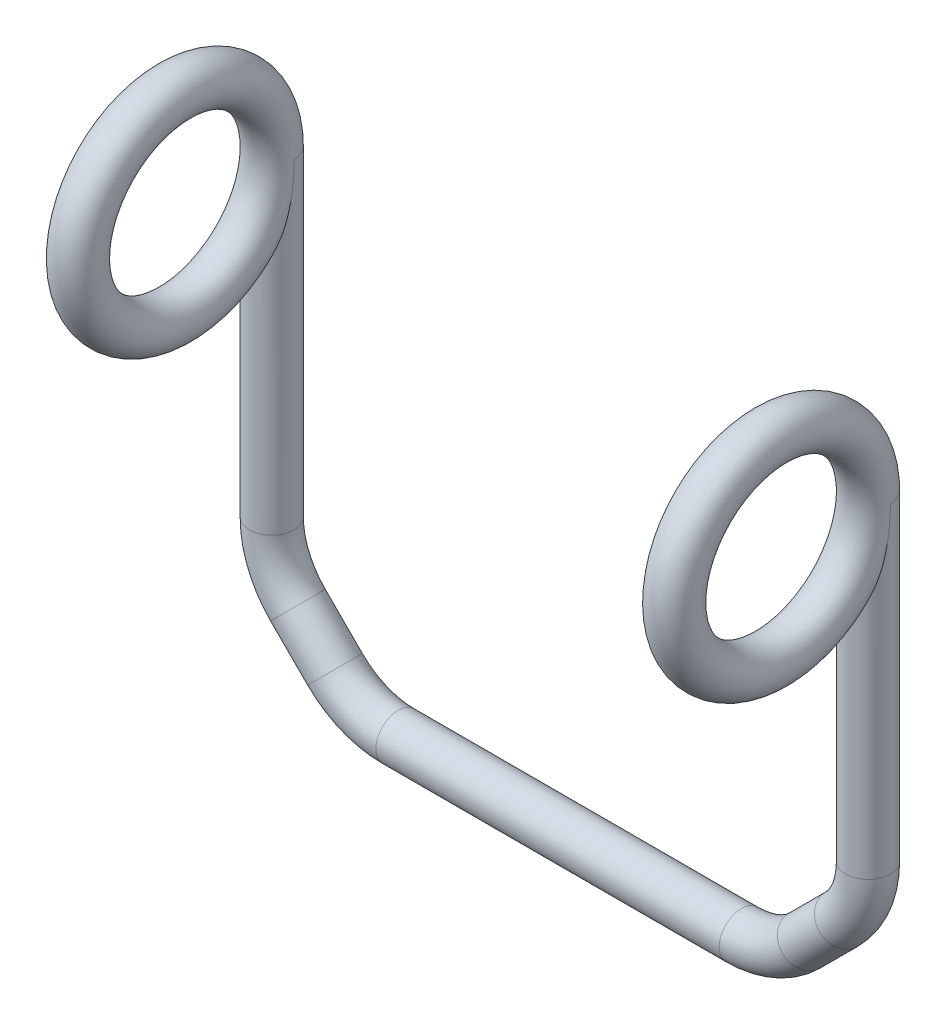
ISO-10303-21;
HEADER;
FILE_DESCRIPTION(('STEP AP214'),'2;1');
FILE_NAME('part.step','',(''),(''),'','','');
FILE_SCHEMA(('AUTOMOTIVE_DESIGN { 1 0 10303 214 1 1 1 1 }'));
ENDSEC;
DATA;
#1=APPLICATION_CONTEXT('core data for automotive mechanical design processes');
#2=APPLICATION_PROTOCOL_DEFINITION('international standard','automotive_design',2000,#1);
#3=PRODUCT_CONTEXT('',#1,'mechanical');
#4=PRODUCT('Part','Part','',(#3));
#5=PRODUCT_RELATED_PRODUCT_CATEGORY('part','',(#4));
#6=PRODUCT_DEFINITION_FORMATION('','',#4);
#7=PRODUCT_DEFINITION_CONTEXT('part definition',#1,'design');
#8=PRODUCT_DEFINITION('design','',#6,#7);
#9=PRODUCT_DEFINITION_SHAPE('','',#8);
#10=(LENGTH_UNIT() NAMED_UNIT(*) SI_UNIT(.MILLI.,.METRE.));
#11=(NAMED_UNIT(*) PLANE_ANGLE_UNIT() SI_UNIT($,.RADIAN.));
#12=(NAMED_UNIT(*) SI_UNIT($,.STERADIAN.) SOLID_ANGLE_UNIT());
#13=UNCERTAINTY_MEASURE_WITH_UNIT(LENGTH_MEASURE(1.E-05),#10,'distance_accuracy_value','');
#14=(GEOMETRIC_REPRESENTATION_CONTEXT(3) GLOBAL_UNCERTAINTY_ASSIGNED_CONTEXT((#13)) GLOBAL_UNIT_ASSIGNED_CONTEXT((#10,
#11,#12)) REPRESENTATION_CONTEXT('',''));
#15=CARTESIAN_POINT('',(0.,0.,0.));
#16=DIRECTION('',(0.,0.,1.));
#17=DIRECTION('',(1.,0.,0.));
#18=AXIS2_PLACEMENT_3D('',#15,#16,#17);
#19=CARTESIAN_POINT('',(10.,4.24264068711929,0.));
#20=DIRECTION('',(0.,1.,0.));
#21=DIRECTION('',(-1.,0.,0.));
#22=AXIS2_PLACEMENT_3D('',#19,#20,#21);
#23=CYLINDRICAL_SURFACE('',#22,0.75);
#24=CARTESIAN_POINT('',(10.,4.24264068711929,0.));
#25=DIRECTION('',(0.,1.,0.));
#26=DIRECTION('',(0.,0.,-1.));
#27=AXIS2_PLACEMENT_3D('',#24,#25,#26);
#28=CIRCLE('',#27,0.75);
#29=CARTESIAN_POINT('',(10.75,4.24264068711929,0.));
#30=VERTEX_POINT('',#29);
#31=EDGE_CURVE('E45',#30,#30,#28,.T.);
#32=ORIENTED_EDGE('',*,*,#31,.T.);
#33=EDGE_LOOP('',(#32));
#34=FACE_BOUND('',#33,.T.);
#35=CARTESIAN_POINT('',(10.,15.,0.));
#36=DIRECTION('',(0.,1.,0.));
#37=DIRECTION('',(0.,0.,-1.));
#38=AXIS2_PLACEMENT_3D('',#35,#36,#37);
#39=CIRCLE('',#38,0.75);
#40=CARTESIAN_POINT('',(10.75,15.,0.));
#41=VERTEX_POINT('',#40);
#42=CARTESIAN_POINT('',(9.24999999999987,15.0000000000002,0.));
#43=VERTEX_POINT('',#42);
#44=EDGE_CURVE('E11',#41,#43,#39,.T.);
#45=ORIENTED_EDGE('',*,*,#44,.F.);
#46=CARTESIAN_POINT('',(9.25,15.0000000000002,0.));
#47=CARTESIAN_POINT('',(9.25000006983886,14.9731247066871,-7.10896213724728E-09));
#48=CARTESIAN_POINT('',(9.24999994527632,14.9462500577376,0.000166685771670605));
#49=CARTESIAN_POINT('',(9.25000019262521,14.9162265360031,0.000539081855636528));
#50=CARTESIAN_POINT('',(9.25000022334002,14.913075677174,0.000580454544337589));
#51=CARTESIAN_POINT('',(9.25000040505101,14.8973214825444,0.000798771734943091));
#52=CARTESIAN_POINT('',(9.25000064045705,14.8847185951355,0.00101007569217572));
#53=CARTESIAN_POINT('',(9.25000118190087,14.8682614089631,0.00133386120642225));
#54=CARTESIAN_POINT('',(9.25000132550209,14.8644064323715,0.00141313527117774));
#55=CARTESIAN_POINT('',(9.2500021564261,14.8451318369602,0.00182664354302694));
#56=CARTESIAN_POINT('',(9.25000318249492,14.8297133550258,0.0022122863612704));
#57=CARTESIAN_POINT('',(9.25001072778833,14.752621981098,0.00441482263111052));
#58=CARTESIAN_POINT('',(9.25002449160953,14.6909697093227,0.00705434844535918));
#59=CARTESIAN_POINT('',(9.25012285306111,14.5696635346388,0.0139710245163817));
#60=CARTESIAN_POINT('',(9.25020525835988,14.5100065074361,0.0181952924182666));
#61=CARTESIAN_POINT('',(9.25066933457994,14.3312540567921,0.033309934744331));
#62=CARTESIAN_POINT('',(9.25126781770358,14.2123558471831,0.0466427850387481));
#63=CARTESIAN_POINT('',(9.25406503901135,13.9749948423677,0.0797301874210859));
#64=CARTESIAN_POINT('',(9.25627014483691,13.8565356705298,0.0995101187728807));
#65=CARTESIAN_POINT('',(9.2638999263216,13.6187518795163,0.145650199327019));
#66=CARTESIAN_POINT('',(9.2693827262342,13.4994510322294,0.172124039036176));
#67=CARTESIAN_POINT('',(9.28584512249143,13.2624571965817,0.231154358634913));
#68=CARTESIAN_POINT('',(9.29683458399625,13.1447674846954,0.263721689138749));
#69=CARTESIAN_POINT('',(9.31977026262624,12.970897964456,0.316456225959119));
#70=CARTESIAN_POINT('',(9.3284324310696,12.913661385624,0.33458290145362));
#71=CARTESIAN_POINT('',(9.34843273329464,12.8000623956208,0.372038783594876));
#72=CARTESIAN_POINT('',(9.35977004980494,12.7436997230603,0.391367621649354));
#73=CARTESIAN_POINT('',(9.38575021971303,12.632294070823,0.430995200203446));
#74=CARTESIAN_POINT('',(9.40038222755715,12.5772474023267,0.451290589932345));
#75=CARTESIAN_POINT('',(9.43385390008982,12.4687590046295,0.492634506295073));
#76=CARTESIAN_POINT('',(9.45268908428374,12.4153156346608,0.513682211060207));
#77=CARTESIAN_POINT('',(9.4823282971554,12.3435151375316,0.542809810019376));
#78=CARTESIAN_POINT('',(9.49078208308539,12.3241304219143,0.550762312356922));
#79=CARTESIAN_POINT('',(9.50854816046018,12.2857583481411,0.566672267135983));
#80=CARTESIAN_POINT('',(9.51786056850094,12.2667710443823,0.574629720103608));
#81=CARTESIAN_POINT('',(9.5472953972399,12.2103958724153,0.598498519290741));
#82=CARTESIAN_POINT('',(9.56886789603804,12.1737136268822,0.614357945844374));
#83=CARTESIAN_POINT('',(9.6171739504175,12.1027661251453,0.64559143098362));
#84=CARTESIAN_POINT('',(9.64397642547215,12.0685425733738,0.660955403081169));
#85=CARTESIAN_POINT('',(9.70384285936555,12.0051771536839,0.689844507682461));
#86=CARTESIAN_POINT('',(9.73686655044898,11.9760048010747,0.703380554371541));
#87=CARTESIAN_POINT('',(9.79059043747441,11.939731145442,0.720392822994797));
#88=CARTESIAN_POINT('',(9.80845628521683,11.9291618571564,0.725381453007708));
#89=CARTESIAN_POINT('',(9.84573166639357,11.9105265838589,0.734212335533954));
#90=CARTESIAN_POINT('',(9.86514027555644,11.9024591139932,0.738055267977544));
#91=CARTESIAN_POINT('',(9.90544323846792,11.8893883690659,0.744296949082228));
#92=CARTESIAN_POINT('',(9.92635104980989,11.8844181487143,0.746680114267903));
#93=CARTESIAN_POINT('',(9.96883760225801,11.8782205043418,0.749653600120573));
#94=CARTESIAN_POINT('',(9.99041560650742,11.8769891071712,0.750245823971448));
#95=CARTESIAN_POINT('',(10.0309279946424,11.878324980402,0.749604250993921));
#96=CARTESIAN_POINT('',(10.0498812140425,11.8804719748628,0.748572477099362));
#97=CARTESIAN_POINT('',(10.0871195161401,11.8875947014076,0.745158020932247));
#98=CARTESIAN_POINT('',(10.1054041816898,11.8925721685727,0.742774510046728));
#99=CARTESIAN_POINT('',(10.145937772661,11.9067153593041,0.736026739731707));
#100=CARTESIAN_POINT('',(10.1678483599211,11.9166668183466,0.73129323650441));
#101=CARTESIAN_POINT('',(10.2096133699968,11.9396369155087,0.720437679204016));
#102=CARTESIAN_POINT('',(10.2294635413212,11.9526617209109,0.714312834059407));
#103=CARTESIAN_POINT('',(10.2778961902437,11.9890695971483,0.69732400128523));
#104=CARTESIAN_POINT('',(10.3049691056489,12.0141129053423,0.685754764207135));
#105=CARTESIAN_POINT('',(10.354751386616,12.0676548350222,0.661378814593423));
#106=CARTESIAN_POINT('',(10.3774495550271,12.0961620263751,0.64856904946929));
#107=CARTESIAN_POINT('',(10.4185477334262,12.1544295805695,0.622803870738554));
#108=CARTESIAN_POINT('',(10.4370657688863,12.1841165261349,0.60986753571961));
#109=CARTESIAN_POINT('',(10.4713333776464,12.2449754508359,0.583786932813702));
#110=CARTESIAN_POINT('',(10.4870802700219,12.2761488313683,0.570642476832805));
#111=CARTESIAN_POINT('',(10.530922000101,12.3713693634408,0.531206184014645));
#112=CARTESIAN_POINT('',(10.5555549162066,12.437019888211,0.504954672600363));
#113=CARTESIAN_POINT('',(10.6023367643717,12.5836822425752,0.448631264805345));
#114=CARTESIAN_POINT('',(10.6230849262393,12.6652102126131,0.418801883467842));
#115=CARTESIAN_POINT('',(10.6579737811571,12.8305538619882,0.361511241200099));
#116=CARTESIAN_POINT('',(10.6721054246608,12.9143725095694,0.33405326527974));
#117=CARTESIAN_POINT('',(10.6955673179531,13.0835877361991,0.281959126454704));
#118=CARTESIAN_POINT('',(10.7048938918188,13.1689854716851,0.257325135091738));
#119=CARTESIAN_POINT('',(10.7200686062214,13.3409268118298,0.21116379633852));
#120=CARTESIAN_POINT('',(10.7259160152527,13.4274706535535,0.189637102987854));
#121=CARTESIAN_POINT('',(10.7356999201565,13.6116903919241,0.147534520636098));
#122=CARTESIAN_POINT('',(10.7393298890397,13.7094759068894,0.127369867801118));
#123=CARTESIAN_POINT('',(10.7446357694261,13.905746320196,0.091367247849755));
#124=CARTESIAN_POINT('',(10.7463144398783,14.0042300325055,0.0755231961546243));
#125=CARTESIAN_POINT('',(10.7481443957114,14.1645544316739,0.0533985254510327));
#126=CARTESIAN_POINT('',(10.7486329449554,14.2262081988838,0.0457646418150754));
#127=CARTESIAN_POINT('',(10.7493377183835,14.3497194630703,0.0322346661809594));
#128=CARTESIAN_POINT('',(10.7495538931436,14.41157699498,0.0263388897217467));
#129=CARTESIAN_POINT('',(10.749871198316,14.5490512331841,0.0152037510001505));
#130=CARTESIAN_POINT('',(10.7499365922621,14.6247033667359,0.0103935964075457));
#131=CARTESIAN_POINT('',(10.7499868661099,14.7450389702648,0.00484715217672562));
#132=CARTESIAN_POINT('',(10.7499937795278,14.7896845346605,0.00324909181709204));
#133=CARTESIAN_POINT('',(10.7499990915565,14.8626830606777,0.00138867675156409));
#134=CARTESIAN_POINT('',(10.7499996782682,14.8910290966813,0.000851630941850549));
#135=CARTESIAN_POINT('',(10.7499999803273,14.9462502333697,0.000166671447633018));
#136=CARTESIAN_POINT('',(10.7499997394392,14.9731251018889,-4.14173930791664E-08));
#137=CARTESIAN_POINT('',(10.75,15.0000000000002,0.));
#138=B_SPLINE_CURVE_WITH_KNOTS('',3,(#46,#47,#48,#49,#50,#51,#52,#53,#54,#55,#56,#57,#58,#59,
#60,#61,#62,#63,#64,#65,#66,#67,#68,#69,#70,#71,#72,#73,#74,#75,#76,#77,#78,#79,#80,#81,#82,#83,
#84,#85,#86,#87,#88,#89,#90,#91,#92,#93,#94,#95,#96,#97,#98,#99,#100,#101,#102,#103,#104,#105,
#106,#107,#108,#109,#110,#111,#112,#113,#114,#115,#116,#117,#118,#119,#120,#121,#122,#123,#124,
#125,#126,#127,#128,#129,#130,#131,#132,#133,#134,#135,#136,#137),.UNSPECIFIED.,.F.,.F.,(4,2,2,
2,2,2,2,2,2,2,2,2,2,2,2,2,2,2,2,2,2,2,2,2,2,2,2,2,2,2,2,2,2,2,2,2,2,2,2,2,2,2,2,2,2,4),(0.,
0.0806241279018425,0.0900775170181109,0.127891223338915,0.139458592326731,0.185728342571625,
0.370824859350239,0.55022661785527,0.908965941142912,1.2691348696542,1.63588853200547,
2.00330159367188,2.18522288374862,2.3670886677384,2.54836431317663,2.72944763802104,
2.79721136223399,2.86498430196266,3.00093940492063,3.13882454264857,3.27584609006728,
3.33970893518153,3.40353380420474,3.46802866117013,3.53245495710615,3.58947746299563,
3.64653496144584,3.71970233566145,3.79301780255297,3.90832098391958,4.02391547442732,
4.1356579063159,4.24750785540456,4.47157466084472,4.73895749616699,5.00670497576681,
5.27465698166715,5.54266530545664,5.84226765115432,6.14144587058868,6.32780250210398,
6.5141929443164,6.74155721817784,6.87557106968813,6.96062205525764,7.04124618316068),.UNSPECIFIED.);
#139=EDGE_CURVE('E52',#41,#43,#138,.F.);
#140=ORIENTED_EDGE('',*,*,#139,.T.);
#141=EDGE_LOOP('',(#45,#140));
#142=FACE_BOUND('',#141,.T.);
#143=ADVANCED_FACE('F37',(#34,#142),#23,.T.);
#144=CARTESIAN_POINT('',(7.,4.24264068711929,0.));
#145=DIRECTION('',(0.,0.,1.));
#146=DIRECTION('',(1.,0.,0.));
#147=AXIS2_PLACEMENT_3D('',#144,#145,#146);
#148=TOROIDAL_SURFACE('',#147,3.,0.75);
#149=CARTESIAN_POINT('',(9.12132034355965,2.12132034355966,0.));
#150=DIRECTION('',(0.707106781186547,0.707106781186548,0.));
#151=DIRECTION('',(0.,0.,-1.));
#152=AXIS2_PLACEMENT_3D('',#149,#150,#151);
#153=CIRCLE('',#152,0.75);
#154=CARTESIAN_POINT('',(9.65165042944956,1.59099025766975,0.));
#155=VERTEX_POINT('',#154);
#156=EDGE_CURVE('E111',#155,#155,#153,.T.);
#157=CARTESIAN_POINT('',(7.,4.24264068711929,0.));
#158=DIRECTION('',(0.,0.,1.));
#159=DIRECTION('',(1.,0.,0.));
#160=AXIS2_PLACEMENT_3D('',#157,#158,#159);
#161=CIRCLE('',#160,3.75);
#162=EDGE_CURVE('',#155,#30,#161,.T.);
#163=ORIENTED_EDGE('',*,*,#156,.T.);
#164=ORIENTED_EDGE('',*,*,#31,.F.);
#165=ORIENTED_EDGE('',*,*,#162,.T.);
#166=ORIENTED_EDGE('',*,*,#162,.F.);
#167=EDGE_LOOP('',(#163,#165,#164,#166));
#168=FACE_BOUND('',#167,.T.);
#169=ADVANCED_FACE('F100',(#168),#148,.T.);
#170=CARTESIAN_POINT('',(7.87867965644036,0.87867965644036,0.));
#171=DIRECTION('',(0.707106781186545,0.707106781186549,0.));
#172=DIRECTION('',(-0.707106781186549,0.707106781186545,0.));
#173=AXIS2_PLACEMENT_3D('',#170,#171,#172);
#174=CYLINDRICAL_SURFACE('',#173,0.75);
#175=CARTESIAN_POINT('',(7.87867965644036,0.87867965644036,0.));
#176=DIRECTION('',(0.707106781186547,0.707106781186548,0.));
#177=DIRECTION('',(0.,0.,-1.));
#178=AXIS2_PLACEMENT_3D('',#175,#176,#177);
#179=CIRCLE('',#178,0.75);
#180=CARTESIAN_POINT('',(8.40900974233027,0.34834957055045,0.));
#181=VERTEX_POINT('',#180);
#182=EDGE_CURVE('E114',#181,#181,#179,.T.);
#183=ORIENTED_EDGE('',*,*,#182,.T.);
#184=EDGE_LOOP('',(#183));
#185=FACE_BOUND('',#184,.T.);
#186=ORIENTED_EDGE('',*,*,#156,.F.);
#187=EDGE_LOOP('',(#186));
#188=FACE_BOUND('',#187,.T.);
#189=ADVANCED_FACE('F97',(#185,#188),#174,.T.);
#190=CARTESIAN_POINT('',(5.75735931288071,3.,0.));
#191=DIRECTION('',(0.,0.,1.));
#192=DIRECTION('',(1.,0.,0.));
#193=AXIS2_PLACEMENT_3D('',#190,#191,#192);
#194=TOROIDAL_SURFACE('',#193,3.,0.75);
#195=CARTESIAN_POINT('',(5.75735931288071,0.,0.));
#196=DIRECTION('',(1.,0.,0.));
#197=DIRECTION('',(0.,0.,-1.));
#198=AXIS2_PLACEMENT_3D('',#195,#196,#197);
#199=CIRCLE('',#198,0.75);
#200=CARTESIAN_POINT('',(5.75735931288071,-0.75,0.));
#201=VERTEX_POINT('',#200);
#202=EDGE_CURVE('E70',#201,#201,#199,.T.);
#203=CARTESIAN_POINT('',(5.75735931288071,3.,0.));
#204=DIRECTION('',(0.,0.,1.));
#205=DIRECTION('',(1.,0.,0.));
#206=AXIS2_PLACEMENT_3D('',#203,#204,#205);
#207=CIRCLE('',#206,3.75);
#208=EDGE_CURVE('',#201,#181,#207,.T.);
#209=ORIENTED_EDGE('',*,*,#202,.T.);
#210=ORIENTED_EDGE('',*,*,#182,.F.);
#211=ORIENTED_EDGE('',*,*,#208,.T.);
#212=ORIENTED_EDGE('',*,*,#208,.F.);
#213=EDGE_LOOP('',(#209,#211,#210,#212));
#214=FACE_BOUND('',#213,.T.);
#215=ADVANCED_FACE('F93',(#214),#194,.T.);
#216=CARTESIAN_POINT('',(5.75735931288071,0.,0.));
#217=DIRECTION('',(-1.,0.,0.));
#218=DIRECTION('',(0.,0.,1.));
#219=AXIS2_PLACEMENT_3D('',#216,#217,#218);
#220=CYLINDRICAL_SURFACE('',#219,0.75);
#221=ORIENTED_EDGE('',*,*,#202,.F.);
#222=EDGE_LOOP('',(#221));
#223=FACE_BOUND('',#222,.T.);
#224=CARTESIAN_POINT('',(-5.75735931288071,0.,0.));
#225=DIRECTION('',(1.,0.,0.));
#226=DIRECTION('',(0.,0.,-1.));
#227=AXIS2_PLACEMENT_3D('',#224,#225,#226);
#228=CIRCLE('',#227,0.75);
#229=CARTESIAN_POINT('',(-5.75735931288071,-0.75,0.));
#230=VERTEX_POINT('',#229);
#231=EDGE_CURVE('E65',#230,#230,#228,.T.);
#232=ORIENTED_EDGE('',*,*,#231,.T.);
#233=EDGE_LOOP('',(#232));
#234=FACE_BOUND('',#233,.T.);
#235=ADVANCED_FACE('F87',(#223,#234),#220,.T.);
#236=CARTESIAN_POINT('',(9.99999999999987,15.0000000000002,3.25));
#237=DIRECTION('',(-1.,0.,0.));
#238=DIRECTION('',(0.,0.,1.));
#239=AXIS2_PLACEMENT_3D('',#236,#237,#238);
#240=TOROIDAL_SURFACE('',#239,3.25,0.749999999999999);
#241=ORIENTED_EDGE('',*,*,#139,.F.);
#242=ORIENTED_EDGE('',*,*,#44,.T.);
#243=EDGE_LOOP('',(#241,#242));
#244=FACE_BOUND('',#243,.T.);
#245=ADVANCED_FACE('F82',(#244),#240,.T.);
#246=CARTESIAN_POINT('',(-10.,4.24264068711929,0.));
#247=DIRECTION('',(0.,1.,0.));
#248=DIRECTION('',(1.,0.,0.));
#249=AXIS2_PLACEMENT_3D('',#246,#247,#248);
#250=CYLINDRICAL_SURFACE('',#249,0.75);
#251=CARTESIAN_POINT('',(-10.,4.24264068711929,0.));
#252=DIRECTION('',(0.,-1.,0.));
#253=DIRECTION('',(0.,0.,-1.));
#254=AXIS2_PLACEMENT_3D('',#251,#252,#253);
#255=CIRCLE('',#254,0.75);
#256=CARTESIAN_POINT('',(-10.75,4.24264068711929,0.));
#257=VERTEX_POINT('',#256);
#258=EDGE_CURVE('E68',#257,#257,#255,.T.);
#259=ORIENTED_EDGE('',*,*,#258,.F.);
#260=EDGE_LOOP('',(#259));
#261=FACE_BOUND('',#260,.T.);
#262=CARTESIAN_POINT('',(-10.,15.,0.));
#263=DIRECTION('',(0.,-1.,0.));
#264=DIRECTION('',(0.,0.,-1.));
#265=AXIS2_PLACEMENT_3D('',#262,#263,#264);
#266=CIRCLE('',#265,0.75);
#267=CARTESIAN_POINT('',(-10.75,15.,0.));
#268=VERTEX_POINT('',#267);
#269=CARTESIAN_POINT('',(-9.24999999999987,15.0000000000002,0.));
#270=VERTEX_POINT('',#269);
#271=EDGE_CURVE('E63',#268,#270,#266,.T.);
#272=ORIENTED_EDGE('',*,*,#271,.T.);
#273=CARTESIAN_POINT('',(-9.25,15.0000000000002,0.));
#274=CARTESIAN_POINT('',(-9.25000006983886,14.9731247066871,-7.10896213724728E-09));
#275=CARTESIAN_POINT('',(-9.24999994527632,14.9462500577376,0.000166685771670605));
#276=CARTESIAN_POINT('',(-9.25000019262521,14.9162265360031,0.000539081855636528));
#277=CARTESIAN_POINT('',(-9.25000022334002,14.913075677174,0.000580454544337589));
#278=CARTESIAN_POINT('',(-9.25000040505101,14.8973214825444,0.000798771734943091));
#279=CARTESIAN_POINT('',(-9.25000064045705,14.8847185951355,0.00101007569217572));
#280=CARTESIAN_POINT('',(-9.25000118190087,14.8682614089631,0.00133386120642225));
#281=CARTESIAN_POINT('',(-9.25000132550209,14.8644064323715,0.00141313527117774));
#282=CARTESIAN_POINT('',(-9.2500021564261,14.8451318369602,0.00182664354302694));
#283=CARTESIAN_POINT('',(-9.25000318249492,14.8297133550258,0.0022122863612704));
#284=CARTESIAN_POINT('',(-9.25001072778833,14.752621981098,0.00441482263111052));
#285=CARTESIAN_POINT('',(-9.25002449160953,14.6909697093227,0.00705434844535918));
#286=CARTESIAN_POINT('',(-9.25012285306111,14.5696635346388,0.0139710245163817));
#287=CARTESIAN_POINT('',(-9.25020525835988,14.5100065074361,0.0181952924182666));
#288=CARTESIAN_POINT('',(-9.25066933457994,14.3312540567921,0.033309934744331));
#289=CARTESIAN_POINT('',(-9.25126781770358,14.2123558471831,0.0466427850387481));
#290=CARTESIAN_POINT('',(-9.25406503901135,13.9749948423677,0.0797301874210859));
#291=CARTESIAN_POINT('',(-9.25627014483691,13.8565356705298,0.0995101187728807));
#292=CARTESIAN_POINT('',(-9.2638999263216,13.6187518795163,0.145650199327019));
#293=CARTESIAN_POINT('',(-9.2693827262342,13.4994510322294,0.172124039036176));
#294=CARTESIAN_POINT('',(-9.28584512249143,13.2624571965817,0.231154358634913));
#295=CARTESIAN_POINT('',(-9.29683458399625,13.1447674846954,0.263721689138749));
#296=CARTESIAN_POINT('',(-9.31977026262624,12.970897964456,0.316456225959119));
#297=CARTESIAN_POINT('',(-9.3284324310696,12.913661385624,0.33458290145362));
#298=CARTESIAN_POINT('',(-9.34843273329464,12.8000623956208,0.372038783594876));
#299=CARTESIAN_POINT('',(-9.35977004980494,12.7436997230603,0.391367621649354));
#300=CARTESIAN_POINT('',(-9.38575021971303,12.632294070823,0.430995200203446));
#301=CARTESIAN_POINT('',(-9.40038222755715,12.5772474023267,0.451290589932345));
#302=CARTESIAN_POINT('',(-9.43385390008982,12.4687590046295,0.492634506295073));
#303=CARTESIAN_POINT('',(-9.45268908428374,12.4153156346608,0.513682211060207));
#304=CARTESIAN_POINT('',(-9.4823282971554,12.3435151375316,0.542809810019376));
#305=CARTESIAN_POINT('',(-9.49078208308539,12.3241304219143,0.550762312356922));
#306=CARTESIAN_POINT('',(-9.50854816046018,12.2857583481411,0.566672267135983));
#307=CARTESIAN_POINT('',(-9.51786056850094,12.2667710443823,0.574629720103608));
#308=CARTESIAN_POINT('',(-9.5472953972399,12.2103958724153,0.598498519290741));
#309=CARTESIAN_POINT('',(-9.56886789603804,12.1737136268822,0.614357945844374));
#310=CARTESIAN_POINT('',(-9.6171739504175,12.1027661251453,0.64559143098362));
#311=CARTESIAN_POINT('',(-9.64397642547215,12.0685425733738,0.660955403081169));
#312=CARTESIAN_POINT('',(-9.70384285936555,12.0051771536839,0.689844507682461));
#313=CARTESIAN_POINT('',(-9.73686655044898,11.9760048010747,0.703380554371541));
#314=CARTESIAN_POINT('',(-9.79059043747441,11.939731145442,0.720392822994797));
#315=CARTESIAN_POINT('',(-9.80845628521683,11.9291618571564,0.725381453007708));
#316=CARTESIAN_POINT('',(-9.84573166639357,11.9105265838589,0.734212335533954));
#317=CARTESIAN_POINT('',(-9.86514027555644,11.9024591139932,0.738055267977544));
#318=CARTESIAN_POINT('',(-9.90544323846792,11.8893883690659,0.744296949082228));
#319=CARTESIAN_POINT('',(-9.92635104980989,11.8844181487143,0.746680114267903));
#320=CARTESIAN_POINT('',(-9.96883760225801,11.8782205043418,0.749653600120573));
#321=CARTESIAN_POINT('',(-9.99041560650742,11.8769891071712,0.750245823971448));
#322=CARTESIAN_POINT('',(-10.0309279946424,11.878324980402,0.749604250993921));
#323=CARTESIAN_POINT('',(-10.0498812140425,11.8804719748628,0.748572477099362));
#324=CARTESIAN_POINT('',(-10.0871195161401,11.8875947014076,0.745158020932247));
#325=CARTESIAN_POINT('',(-10.1054041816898,11.8925721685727,0.742774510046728));
#326=CARTESIAN_POINT('',(-10.145937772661,11.9067153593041,0.736026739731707));
#327=CARTESIAN_POINT('',(-10.1678483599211,11.9166668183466,0.73129323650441));
#328=CARTESIAN_POINT('',(-10.2096133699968,11.9396369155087,0.720437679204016));
#329=CARTESIAN_POINT('',(-10.2294635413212,11.9526617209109,0.714312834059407));
#330=CARTESIAN_POINT('',(-10.2778961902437,11.9890695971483,0.69732400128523));
#331=CARTESIAN_POINT('',(-10.3049691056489,12.0141129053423,0.685754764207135));
#332=CARTESIAN_POINT('',(-10.354751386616,12.0676548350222,0.661378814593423));
#333=CARTESIAN_POINT('',(-10.3774495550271,12.0961620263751,0.64856904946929));
#334=CARTESIAN_POINT('',(-10.4185477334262,12.1544295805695,0.622803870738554));
#335=CARTESIAN_POINT('',(-10.4370657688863,12.1841165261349,0.60986753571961));
#336=CARTESIAN_POINT('',(-10.4713333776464,12.2449754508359,0.583786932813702));
#337=CARTESIAN_POINT('',(-10.4870802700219,12.2761488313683,0.570642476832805));
#338=CARTESIAN_POINT('',(-10.530922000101,12.3713693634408,0.531206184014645));
#339=CARTESIAN_POINT('',(-10.5555549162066,12.437019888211,0.504954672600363));
#340=CARTESIAN_POINT('',(-10.6023367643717,12.5836822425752,0.448631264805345));
#341=CARTESIAN_POINT('',(-10.6230849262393,12.6652102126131,0.418801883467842));
#342=CARTESIAN_POINT('',(-10.6579737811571,12.8305538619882,0.361511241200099));
#343=CARTESIAN_POINT('',(-10.6721054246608,12.9143725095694,0.33405326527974));
#344=CARTESIAN_POINT('',(-10.6955673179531,13.0835877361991,0.281959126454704));
#345=CARTESIAN_POINT('',(-10.7048938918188,13.1689854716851,0.257325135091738));
#346=CARTESIAN_POINT('',(-10.7200686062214,13.3409268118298,0.21116379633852));
#347=CARTESIAN_POINT('',(-10.7259160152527,13.4274706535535,0.189637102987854));
#348=CARTESIAN_POINT('',(-10.7356999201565,13.6116903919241,0.147534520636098));
#349=CARTESIAN_POINT('',(-10.7393298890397,13.7094759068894,0.127369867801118));
#350=CARTESIAN_POINT('',(-10.7446357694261,13.905746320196,0.091367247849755));
#351=CARTESIAN_POINT('',(-10.7463144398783,14.0042300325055,0.0755231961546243));
#352=CARTESIAN_POINT('',(-10.7481443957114,14.1645544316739,0.0533985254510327));
#353=CARTESIAN_POINT('',(-10.7486329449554,14.2262081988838,0.0457646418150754));
#354=CARTESIAN_POINT('',(-10.7493377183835,14.3497194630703,0.0322346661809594));
#355=CARTESIAN_POINT('',(-10.7495538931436,14.41157699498,0.0263388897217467));
#356=CARTESIAN_POINT('',(-10.749871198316,14.5490512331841,0.0152037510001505));
#357=CARTESIAN_POINT('',(-10.7499365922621,14.6247033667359,0.0103935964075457));
#358=CARTESIAN_POINT('',(-10.7499868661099,14.7450389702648,0.00484715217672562));
#359=CARTESIAN_POINT('',(-10.7499937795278,14.7896845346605,0.00324909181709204));
#360=CARTESIAN_POINT('',(-10.7499990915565,14.8626830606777,0.00138867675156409));
#361=CARTESIAN_POINT('',(-10.7499996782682,14.8910290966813,0.000851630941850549));
#362=CARTESIAN_POINT('',(-10.7499999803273,14.9462502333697,0.000166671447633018));
#363=CARTESIAN_POINT('',(-10.7499997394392,14.9731251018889,-4.14173930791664E-08));
#364=CARTESIAN_POINT('',(-10.75,15.0000000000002,0.));
#365=B_SPLINE_CURVE_WITH_KNOTS('',3,(#273,#274,#275,#276,#277,#278,#279,#280,#281,#282,#283,
#284,#285,#286,#287,#288,#289,#290,#291,#292,#293,#294,#295,#296,#297,#298,#299,#300,#301,#302,
#303,#304,#305,#306,#307,#308,#309,#310,#311,#312,#313,#314,#315,#316,#317,#318,#319,#320,#321,
#322,#323,#324,#325,#326,#327,#328,#329,#330,#331,#332,#333,#334,#335,#336,#337,#338,#339,#340,
#341,#342,#343,#344,#345,#346,#347,#348,#349,#350,#351,#352,#353,#354,#355,#356,#357,#358,#359,
#360,#361,#362,#363,#364),.UNSPECIFIED.,.F.,.F.,(4,2,2,2,2,2,2,2,2,2,2,2,2,2,2,2,2,2,2,2,2,2,2,
2,2,2,2,2,2,2,2,2,2,2,2,2,2,2,2,2,2,2,2,2,2,4),(0.,0.0806241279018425,0.0900775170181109,
0.127891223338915,0.139458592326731,0.185728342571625,0.370824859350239,0.55022661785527,
0.908965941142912,1.2691348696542,1.63588853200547,2.00330159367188,2.18522288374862,
2.3670886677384,2.54836431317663,2.72944763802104,2.79721136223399,2.86498430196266,
3.00093940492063,3.13882454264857,3.27584609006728,3.33970893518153,3.40353380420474,
3.46802866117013,3.53245495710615,3.58947746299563,3.64653496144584,3.71970233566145,
3.79301780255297,3.90832098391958,4.02391547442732,4.1356579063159,4.24750785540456,
4.47157466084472,4.73895749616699,5.00670497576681,5.27465698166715,5.54266530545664,
5.84226765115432,6.14144587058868,6.32780250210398,6.5141929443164,6.74155721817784,
6.87557106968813,6.96062205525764,7.04124618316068),.UNSPECIFIED.);
#366=EDGE_CURVE('E60',#268,#270,#365,.F.);
#367=ORIENTED_EDGE('',*,*,#366,.F.);
#368=EDGE_LOOP('',(#272,#367));
#369=FACE_BOUND('',#368,.T.);
#370=ADVANCED_FACE('F67',(#261,#369),#250,.T.);
#371=CARTESIAN_POINT('',(-7.,4.24264068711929,0.));
#372=DIRECTION('',(0.,0.,1.));
#373=DIRECTION('',(-1.,0.,0.));
#374=AXIS2_PLACEMENT_3D('',#371,#372,#373);
#375=TOROIDAL_SURFACE('',#374,3.,0.75);
#376=CARTESIAN_POINT('',(-9.12132034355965,2.12132034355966,0.));
#377=DIRECTION('',(0.707106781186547,-0.707106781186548,0.));
#378=DIRECTION('',(0.,0.,-1.));
#379=AXIS2_PLACEMENT_3D('',#376,#377,#378);
#380=CIRCLE('',#379,0.75);
#381=CARTESIAN_POINT('',(-9.65165042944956,1.59099025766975,0.));
#382=VERTEX_POINT('',#381);
#383=EDGE_CURVE('E73',#382,#382,#380,.T.);
#384=CARTESIAN_POINT('',(-7.,4.24264068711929,0.));
#385=DIRECTION('',(0.,0.,1.));
#386=DIRECTION('',(-1.,0.,0.));
#387=AXIS2_PLACEMENT_3D('',#384,#385,#386);
#388=CIRCLE('',#387,3.75);
#389=EDGE_CURVE('',#257,#382,#388,.T.);
#390=ORIENTED_EDGE('',*,*,#258,.T.);
#391=ORIENTED_EDGE('',*,*,#383,.F.);
#392=ORIENTED_EDGE('',*,*,#389,.T.);
#393=ORIENTED_EDGE('',*,*,#389,.F.);
#394=EDGE_LOOP('',(#390,#392,#391,#393));
#395=FACE_BOUND('',#394,.T.);
#396=ADVANCED_FACE('F138',(#395),#375,.T.);
#397=CARTESIAN_POINT('',(-7.87867965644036,0.87867965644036,0.));
#398=DIRECTION('',(-0.707106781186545,0.707106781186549,0.));
#399=DIRECTION('',(0.707106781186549,0.707106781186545,0.));
#400=AXIS2_PLACEMENT_3D('',#397,#398,#399);
#401=CYLINDRICAL_SURFACE('',#400,0.75);
#402=CARTESIAN_POINT('',(-7.87867965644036,0.87867965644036,0.));
#403=DIRECTION('',(0.707106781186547,-0.707106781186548,0.));
#404=DIRECTION('',(0.,0.,-1.));
#405=AXIS2_PLACEMENT_3D('',#402,#403,#404);
#406=CIRCLE('',#405,0.75);
#407=CARTESIAN_POINT('',(-8.40900974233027,0.34834957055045,0.));
#408=VERTEX_POINT('',#407);
#409=EDGE_CURVE('E125',#408,#408,#406,.T.);
#410=ORIENTED_EDGE('',*,*,#409,.F.);
#411=EDGE_LOOP('',(#410));
#412=FACE_BOUND('',#411,.T.);
#413=ORIENTED_EDGE('',*,*,#383,.T.);
#414=EDGE_LOOP('',(#413));
#415=FACE_BOUND('',#414,.T.);
#416=ADVANCED_FACE('F136',(#412,#415),#401,.T.);
#417=CARTESIAN_POINT('',(-5.75735931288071,3.,0.));
#418=DIRECTION('',(0.,0.,1.));
#419=DIRECTION('',(-1.,0.,0.));
#420=AXIS2_PLACEMENT_3D('',#417,#418,#419);
#421=TOROIDAL_SURFACE('',#420,3.,0.75);
#422=CARTESIAN_POINT('',(-5.75735931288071,3.,0.));
#423=DIRECTION('',(0.,0.,1.));
#424=DIRECTION('',(-1.,0.,0.));
#425=AXIS2_PLACEMENT_3D('',#422,#423,#424);
#426=CIRCLE('',#425,3.75);
#427=EDGE_CURVE('',#408,#230,#426,.T.);
#428=ORIENTED_EDGE('',*,*,#409,.T.);
#429=ORIENTED_EDGE('',*,*,#231,.F.);
#430=ORIENTED_EDGE('',*,*,#427,.T.);
#431=ORIENTED_EDGE('',*,*,#427,.F.);
#432=EDGE_LOOP('',(#428,#430,#429,#431));
#433=FACE_BOUND('',#432,.T.);
#434=ADVANCED_FACE('F159',(#433),#421,.T.);
#435=CARTESIAN_POINT('',(-9.99999999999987,15.0000000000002,3.25));
#436=DIRECTION('',(1.,0.,0.));
#437=DIRECTION('',(0.,0.,1.));
#438=AXIS2_PLACEMENT_3D('',#435,#436,#437);
#439=TOROIDAL_SURFACE('',#438,3.25,0.749999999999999);
#440=ORIENTED_EDGE('',*,*,#366,.T.);
#441=ORIENTED_EDGE('',*,*,#271,.F.);
#442=EDGE_LOOP('',(#440,#441));
#443=FACE_BOUND('',#442,.T.);
#444=ADVANCED_FACE('F62',(#443),#439,.T.);
#445=CLOSED_SHELL('',(#143,#169,#189,#215,#235,#245,#370,#396,#416,#434,#444));
#446=MANIFOLD_SOLID_BREP('B2',#445);
#447=ADVANCED_BREP_SHAPE_REPRESENTATION('',(#18,#446),#14);
#448=SHAPE_DEFINITION_REPRESENTATION(#9,#447);
ENDSEC;
END-ISO-10303-21;
